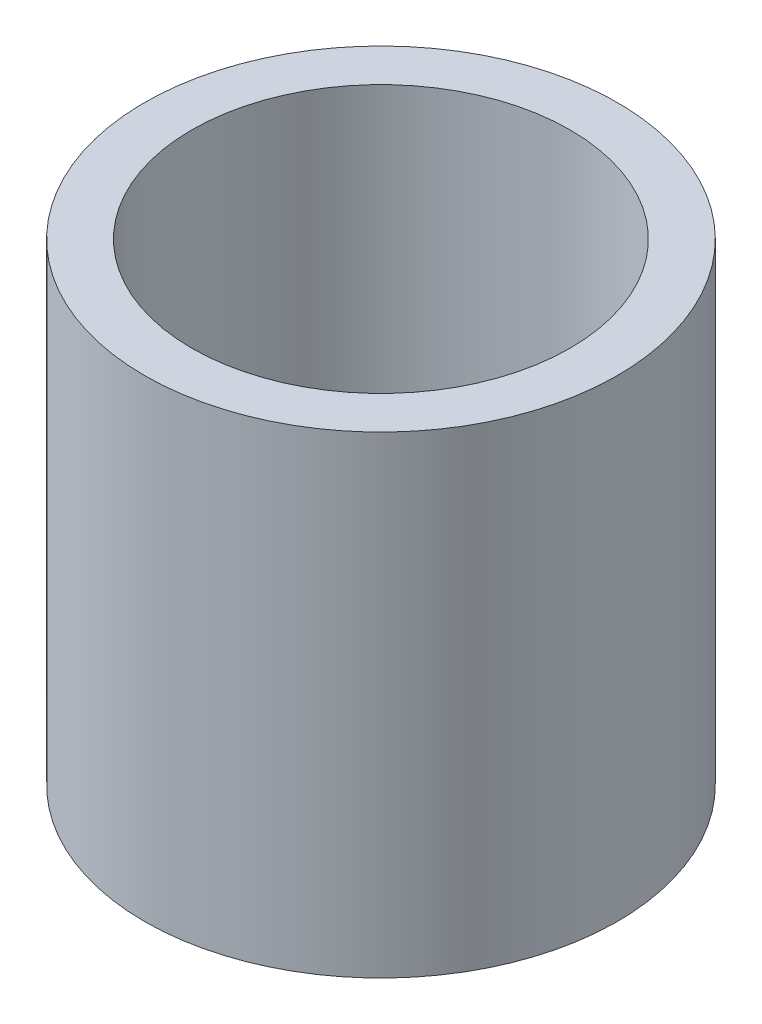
ISO-10303-21;
HEADER;
FILE_DESCRIPTION(('STEP AP214'),'2;1');
FILE_NAME('part.step','',(''),(''),'','','');
FILE_SCHEMA(('AUTOMOTIVE_DESIGN { 1 0 10303 214 1 1 1 1 }'));
ENDSEC;
DATA;
#1=APPLICATION_CONTEXT('core data for automotive mechanical design processes');
#2=APPLICATION_PROTOCOL_DEFINITION('international standard','automotive_design',2000,#1);
#3=PRODUCT_CONTEXT('',#1,'mechanical');
#4=PRODUCT('Part','Part','',(#3));
#5=PRODUCT_RELATED_PRODUCT_CATEGORY('part','',(#4));
#6=PRODUCT_DEFINITION_FORMATION('','',#4);
#7=PRODUCT_DEFINITION_CONTEXT('part definition',#1,'design');
#8=PRODUCT_DEFINITION('design','',#6,#7);
#9=PRODUCT_DEFINITION_SHAPE('','',#8);
#10=(LENGTH_UNIT() NAMED_UNIT(*) SI_UNIT(.MILLI.,.METRE.));
#11=(NAMED_UNIT(*) PLANE_ANGLE_UNIT() SI_UNIT($,.RADIAN.));
#12=(NAMED_UNIT(*) SI_UNIT($,.STERADIAN.) SOLID_ANGLE_UNIT());
#13=UNCERTAINTY_MEASURE_WITH_UNIT(LENGTH_MEASURE(1.E-05),#10,'distance_accuracy_value','');
#14=(GEOMETRIC_REPRESENTATION_CONTEXT(3) GLOBAL_UNCERTAINTY_ASSIGNED_CONTEXT((#13)) GLOBAL_UNIT_ASSIGNED_CONTEXT((#10,
#11,#12)) REPRESENTATION_CONTEXT('',''));
#15=CARTESIAN_POINT('',(0.,0.,0.));
#16=DIRECTION('',(0.,0.,1.));
#17=DIRECTION('',(1.,0.,0.));
#18=AXIS2_PLACEMENT_3D('',#15,#16,#17);
#19=CARTESIAN_POINT('',(0.,100.,0.));
#20=DIRECTION('',(0.,1.,0.));
#21=DIRECTION('',(0.,0.,1.));
#22=AXIS2_PLACEMENT_3D('',#19,#20,#21);
#23=PLANE('',#22);
#24=CARTESIAN_POINT('',(0.,100.,0.));
#25=DIRECTION('',(0.,1.,0.));
#26=DIRECTION('',(0.,0.,1.));
#27=AXIS2_PLACEMENT_3D('',#24,#25,#26);
#28=CIRCLE('',#27,50.);
#29=CARTESIAN_POINT('',(0.,100.,50.));
#30=VERTEX_POINT('',#29);
#31=EDGE_CURVE('E10',#30,#30,#28,.T.);
#32=ORIENTED_EDGE('',*,*,#31,.T.);
#33=EDGE_LOOP('',(#32));
#34=FACE_BOUND('',#33,.T.);
#35=CARTESIAN_POINT('',(0.,100.,0.));
#36=DIRECTION('',(0.,1.,0.));
#37=DIRECTION('',(0.,0.,1.));
#38=AXIS2_PLACEMENT_3D('',#35,#36,#37);
#39=CIRCLE('',#38,40.);
#40=CARTESIAN_POINT('',(0.,100.,40.));
#41=VERTEX_POINT('',#40);
#42=EDGE_CURVE('E55',#41,#41,#39,.T.);
#43=ORIENTED_EDGE('',*,*,#42,.F.);
#44=EDGE_LOOP('',(#43));
#45=FACE_BOUND('',#44,.T.);
#46=ADVANCED_FACE('F42',(#34,#45),#23,.T.);
#47=CARTESIAN_POINT('',(0.,0.,0.));
#48=DIRECTION('',(0.,1.,0.));
#49=DIRECTION('',(0.,0.,1.));
#50=AXIS2_PLACEMENT_3D('',#47,#48,#49);
#51=PLANE('',#50);
#52=CARTESIAN_POINT('',(0.,0.,0.));
#53=DIRECTION('',(0.,1.,0.));
#54=DIRECTION('',(0.,0.,1.));
#55=AXIS2_PLACEMENT_3D('',#52,#53,#54);
#56=CIRCLE('',#55,50.);
#57=CARTESIAN_POINT('',(0.,0.,50.));
#58=VERTEX_POINT('',#57);
#59=EDGE_CURVE('E46',#58,#58,#56,.T.);
#60=ORIENTED_EDGE('',*,*,#59,.F.);
#61=EDGE_LOOP('',(#60));
#62=FACE_BOUND('',#61,.T.);
#63=CARTESIAN_POINT('',(0.,0.,0.));
#64=DIRECTION('',(0.,1.,0.));
#65=DIRECTION('',(0.,0.,1.));
#66=AXIS2_PLACEMENT_3D('',#63,#64,#65);
#67=CIRCLE('',#66,40.);
#68=CARTESIAN_POINT('',(0.,0.,40.));
#69=VERTEX_POINT('',#68);
#70=EDGE_CURVE('E57',#69,#69,#67,.T.);
#71=ORIENTED_EDGE('',*,*,#70,.T.);
#72=EDGE_LOOP('',(#71));
#73=FACE_BOUND('',#72,.T.);
#74=ADVANCED_FACE('F69',(#62,#73),#51,.F.);
#75=CARTESIAN_POINT('',(0.,100.,0.));
#76=DIRECTION('',(0.,-1.,0.));
#77=DIRECTION('',(0.,0.,-1.));
#78=AXIS2_PLACEMENT_3D('',#75,#76,#77);
#79=CYLINDRICAL_SURFACE('',#78,50.);
#80=ORIENTED_EDGE('',*,*,#31,.F.);
#81=EDGE_LOOP('',(#80));
#82=FACE_BOUND('',#81,.T.);
#83=ORIENTED_EDGE('',*,*,#59,.T.);
#84=EDGE_LOOP('',(#83));
#85=FACE_BOUND('',#84,.T.);
#86=ADVANCED_FACE('F44',(#82,#85),#79,.T.);
#87=CARTESIAN_POINT('',(0.,100.,0.));
#88=DIRECTION('',(0.,-1.,0.));
#89=DIRECTION('',(0.,0.,-1.));
#90=AXIS2_PLACEMENT_3D('',#87,#88,#89);
#91=CYLINDRICAL_SURFACE('',#90,40.);
#92=ORIENTED_EDGE('',*,*,#42,.T.);
#93=EDGE_LOOP('',(#92));
#94=FACE_BOUND('',#93,.T.);
#95=ORIENTED_EDGE('',*,*,#70,.F.);
#96=EDGE_LOOP('',(#95));
#97=FACE_BOUND('',#96,.T.);
#98=ADVANCED_FACE('F65',(#94,#97),#91,.F.);
#99=CLOSED_SHELL('',(#46,#74,#86,#98));
#100=MANIFOLD_SOLID_BREP('B2',#99);
#101=ADVANCED_BREP_SHAPE_REPRESENTATION('',(#18,#100),#14);
#102=SHAPE_DEFINITION_REPRESENTATION(#9,#101);
ENDSEC;
END-ISO-10303-21;
